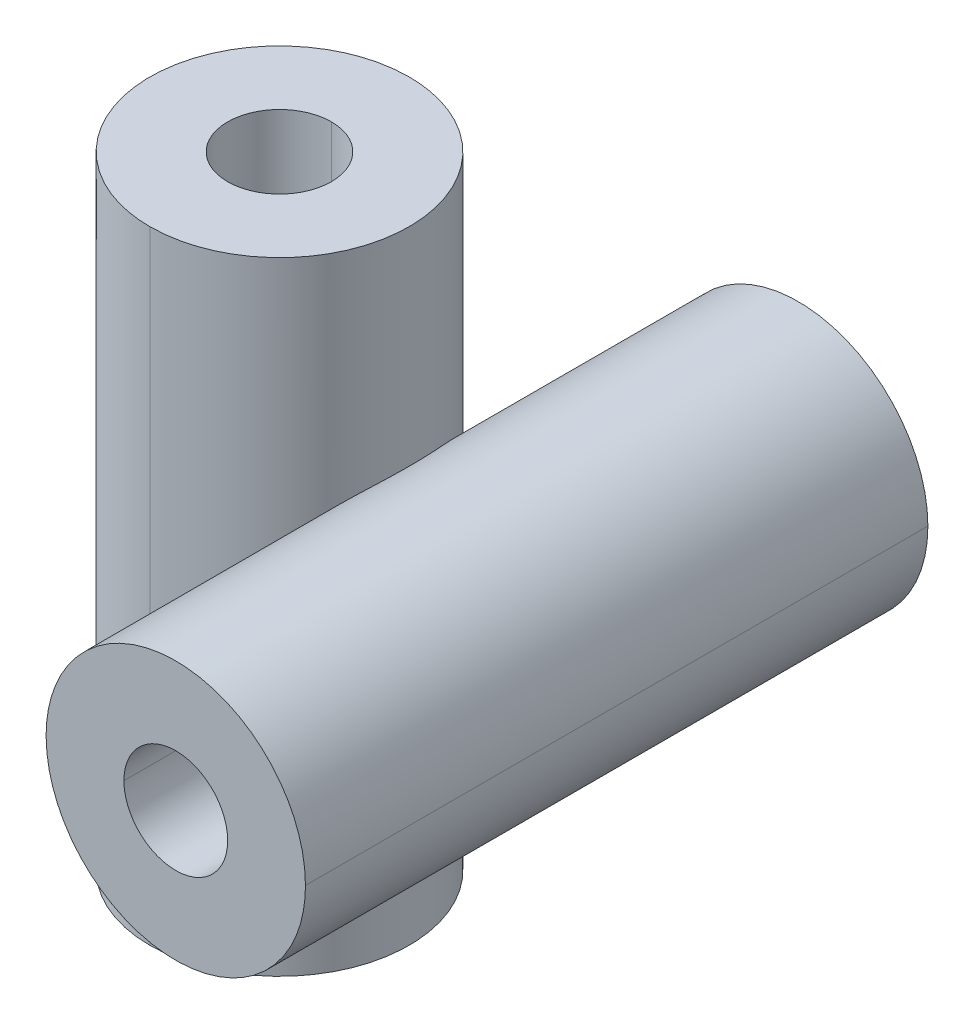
ISO-10303-21;
HEADER;
FILE_DESCRIPTION(('STEP AP214'),'2;1');
FILE_NAME('part.step','',(''),(''),'','','');
FILE_SCHEMA(('AUTOMOTIVE_DESIGN { 1 0 10303 214 1 1 1 1 }'));
ENDSEC;
DATA;
#1=APPLICATION_CONTEXT('core data for automotive mechanical design processes');
#2=APPLICATION_PROTOCOL_DEFINITION('international standard','automotive_design',2000,#1);
#3=PRODUCT_CONTEXT('',#1,'mechanical');
#4=PRODUCT('Part','Part','',(#3));
#5=PRODUCT_RELATED_PRODUCT_CATEGORY('part','',(#4));
#6=PRODUCT_DEFINITION_FORMATION('','',#4);
#7=PRODUCT_DEFINITION_CONTEXT('part definition',#1,'design');
#8=PRODUCT_DEFINITION('design','',#6,#7);
#9=PRODUCT_DEFINITION_SHAPE('','',#8);
#10=(LENGTH_UNIT() NAMED_UNIT(*) SI_UNIT(.MILLI.,.METRE.));
#11=(NAMED_UNIT(*) PLANE_ANGLE_UNIT() SI_UNIT($,.RADIAN.));
#12=(NAMED_UNIT(*) SI_UNIT($,.STERADIAN.) SOLID_ANGLE_UNIT());
#13=UNCERTAINTY_MEASURE_WITH_UNIT(LENGTH_MEASURE(1.E-05),#10,'distance_accuracy_value','');
#14=(GEOMETRIC_REPRESENTATION_CONTEXT(3) GLOBAL_UNCERTAINTY_ASSIGNED_CONTEXT((#13)) GLOBAL_UNIT_ASSIGNED_CONTEXT((#10,
#11,#12)) REPRESENTATION_CONTEXT('',''));
#15=CARTESIAN_POINT('',(0.,0.,0.));
#16=DIRECTION('',(0.,0.,1.));
#17=DIRECTION('',(1.,0.,0.));
#18=AXIS2_PLACEMENT_3D('',#15,#16,#17);
#19=CARTESIAN_POINT('',(5.00000096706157,14.9999984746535,-3.21976739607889E-07));
#20=DIRECTION('',(0.,-1.,0.));
#21=DIRECTION('',(1.,0.,0.));
#22=AXIS2_PLACEMENT_3D('',#19,#20,#21);
#23=CYLINDRICAL_SURFACE('',#22,6.25);
#24=CARTESIAN_POINT('',(5.00000096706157,14.9999984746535,-6.25000032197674));
#25=CARTESIAN_POINT('',(3.86146031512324,14.9999984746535,-6.24953774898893));
#26=CARTESIAN_POINT('',(2.74621364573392,14.9999984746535,-5.93979371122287));
#27=CARTESIAN_POINT('',(0.82773820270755,14.9999984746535,-4.78198901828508));
#28=CARTESIAN_POINT('',(0.0510330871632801,14.9999984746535,-3.97271947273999));
#29=CARTESIAN_POINT('',(-1.2024933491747,14.9999984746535,-1.68930926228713));
#30=CARTESIAN_POINT('',(-1.42642312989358,14.9999984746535,-0.15467208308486));
#31=CARTESIAN_POINT('',(-0.909966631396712,14.9999984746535,2.24599549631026));
#32=CARTESIAN_POINT('',(-0.499426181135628,14.9999984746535,3.11848841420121));
#33=CARTESIAN_POINT('',(1.07236510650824,14.9999984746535,5.11416372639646));
#34=CARTESIAN_POINT('',(2.49183642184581,14.9999984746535,5.94098080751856));
#35=CARTESIAN_POINT('',(4.37265824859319,14.9999984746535,6.22623705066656));
#36=CARTESIAN_POINT('',(4.6861106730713,14.9999984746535,6.24987214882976));
#37=CARTESIAN_POINT('',(5.00000096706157,14.9999984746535,6.24999967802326));
#38=B_SPLINE_CURVE_WITH_KNOTS('',3,(#24,#25,#26,#27,#28,#29,#30,#31,#32,#33,#34,#35,#36,#37),
.UNSPECIFIED.,.F.,.F.,(4,2,2,2,2,2,4),(0.,0.172601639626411,0.339653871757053,0.567466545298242,
0.711758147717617,0.952421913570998,1.),.UNSPECIFIED.);
#39=CARTESIAN_POINT('',(5.00000096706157,14.9999984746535,-6.25000032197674));
#40=VERTEX_POINT('',#39);
#41=CARTESIAN_POINT('',(5.00000096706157,14.9999984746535,6.24999967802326));
#42=VERTEX_POINT('',#41);
#43=EDGE_CURVE('E11',#40,#42,#38,.T.);
#44=ORIENTED_EDGE('',*,*,#43,.F.);
#45=CARTESIAN_POINT('',(5.00000096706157,14.9999984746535,-6.25000032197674));
#46=DIRECTION('',(0.,-1.,0.));
#47=VECTOR('',#46,1.);
#48=LINE('',#45,#47);
#49=CARTESIAN_POINT('',(5.00000096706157,-15.0000015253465,-6.25000032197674));
#50=VERTEX_POINT('',#49);
#51=EDGE_CURVE('E25',#40,#50,#48,.T.);
#52=ORIENTED_EDGE('',*,*,#51,.T.);
#53=CARTESIAN_POINT('',(5.00000096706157,-15.0000015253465,-3.21976739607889E-07));
#54=DIRECTION('',(0.,1.,0.));
#55=DIRECTION('',(0.,0.,-1.));
#56=AXIS2_PLACEMENT_3D('',#53,#54,#55);
#57=CIRCLE('',#56,6.25);
#58=CARTESIAN_POINT('',(5.00000096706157,-15.0000015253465,6.24999967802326));
#59=VERTEX_POINT('',#58);
#60=EDGE_CURVE('E148',#50,#59,#57,.T.);
#61=ORIENTED_EDGE('',*,*,#60,.T.);
#62=CARTESIAN_POINT('',(5.00000096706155,-15.0000015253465,6.24999967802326));
#63=DIRECTION('',(0.,1.,0.));
#64=VECTOR('',#63,1.);
#65=LINE('',#62,#64);
#66=EDGE_CURVE('E152',#59,#42,#65,.T.);
#67=ORIENTED_EDGE('',*,*,#66,.T.);
#68=EDGE_LOOP('',(#44,#52,#61,#67));
#69=FACE_BOUND('',#68,.T.);
#70=ADVANCED_FACE('F16',(#69),#23,.T.);
#71=CARTESIAN_POINT('',(5.00000096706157,14.9999984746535,-3.21976739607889E-07));
#72=DIRECTION('',(0.,-1.,0.));
#73=DIRECTION('',(-1.,0.,0.));
#74=AXIS2_PLACEMENT_3D('',#71,#72,#73);
#75=CYLINDRICAL_SURFACE('',#74,6.25);
#76=CARTESIAN_POINT('',(5.00000096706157,-15.0000015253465,-3.21976739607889E-07));
#77=DIRECTION('',(0.,1.,0.));
#78=DIRECTION('',(0.,0.,1.));
#79=AXIS2_PLACEMENT_3D('',#76,#77,#78);
#80=CIRCLE('',#79,6.25);
#81=EDGE_CURVE('E147',#59,#50,#80,.T.);
#82=ORIENTED_EDGE('',*,*,#81,.T.);
#83=ORIENTED_EDGE('',*,*,#51,.F.);
#84=CARTESIAN_POINT('',(5.00000096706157,14.9999984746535,6.24999967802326));
#85=CARTESIAN_POINT('',(6.13854161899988,14.9999984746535,6.24953710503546));
#86=CARTESIAN_POINT('',(7.25378828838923,14.9999984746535,5.93979306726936));
#87=CARTESIAN_POINT('',(9.17226373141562,14.9999984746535,4.78198837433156));
#88=CARTESIAN_POINT('',(9.94896884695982,14.9999984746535,3.97271882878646));
#89=CARTESIAN_POINT('',(11.2024952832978,14.9999984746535,1.68930861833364));
#90=CARTESIAN_POINT('',(11.4264250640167,14.9999984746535,0.15467143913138));
#91=CARTESIAN_POINT('',(10.9099685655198,14.9999984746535,-2.24599614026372));
#92=CARTESIAN_POINT('',(10.4994281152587,14.9999984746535,-3.11848905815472));
#93=CARTESIAN_POINT('',(8.92763682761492,14.9999984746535,-5.11416437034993));
#94=CARTESIAN_POINT('',(7.50816551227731,14.9999984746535,-5.94098145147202));
#95=CARTESIAN_POINT('',(5.62734368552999,14.9999984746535,-6.22623769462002));
#96=CARTESIAN_POINT('',(5.3138912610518,14.9999984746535,-6.24987279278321));
#97=CARTESIAN_POINT('',(5.00000096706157,14.9999984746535,-6.25000032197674));
#98=B_SPLINE_CURVE_WITH_KNOTS('',3,(#84,#85,#86,#87,#88,#89,#90,#91,#92,#93,#94,#95,#96,#97),
.UNSPECIFIED.,.F.,.F.,(4,2,2,2,2,2,4),(0.,0.172601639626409,0.339653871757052,0.567466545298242,
0.711758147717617,0.952421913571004,1.),.UNSPECIFIED.);
#99=EDGE_CURVE('E153',#42,#40,#98,.T.);
#100=ORIENTED_EDGE('',*,*,#99,.F.);
#101=ORIENTED_EDGE('',*,*,#66,.F.);
#102=EDGE_LOOP('',(#82,#83,#100,#101));
#103=FACE_BOUND('',#102,.T.);
#104=CARTESIAN_POINT('',(8.7500009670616,-1.52534650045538E-06,-5.0000003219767));
#105=CARTESIAN_POINT('',(8.75000052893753,0.0509860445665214,-5.00000277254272));
#106=CARTESIAN_POINT('',(8.750624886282,0.101973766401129,-4.99954361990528));
#107=CARTESIAN_POINT('',(8.75312501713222,0.204103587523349,-4.99769070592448));
#108=CARTESIAN_POINT('',(8.75500573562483,0.255245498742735,-4.99629325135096));
#109=CARTESIAN_POINT('',(8.76002896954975,0.357608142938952,-4.99254577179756));
#110=CARTESIAN_POINT('',(8.76317578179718,0.408828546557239,-4.99019250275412));
#111=CARTESIAN_POINT('',(8.77073578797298,0.511272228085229,-4.98451497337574));
#112=CARTESIAN_POINT('',(8.77515263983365,0.56249508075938,-4.98118790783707));
#113=CARTESIAN_POINT('',(8.78525231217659,0.664867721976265,-4.97354449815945));
#114=CARTESIAN_POINT('',(8.79093817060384,0.716017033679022,-4.96922577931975));
#115=CARTESIAN_POINT('',(8.80357021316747,0.818166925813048,-4.95958074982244));
#116=CARTESIAN_POINT('',(8.81051883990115,0.86916701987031,-4.9542524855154));
#117=CARTESIAN_POINT('',(8.82566562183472,0.970943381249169,-4.94257006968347));
#118=CARTESIAN_POINT('',(8.83386565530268,1.02171919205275,-4.93621437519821));
#119=CARTESIAN_POINT('',(8.85149932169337,1.12297275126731,-4.92245881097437));
#120=CARTESIAN_POINT('',(8.86093430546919,1.17345010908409,-4.91505779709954));
#121=CARTESIAN_POINT('',(8.88101687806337,1.27403367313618,-4.89919331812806));
#122=CARTESIAN_POINT('',(8.89166533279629,1.32413958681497,-4.89072909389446));
#123=CARTESIAN_POINT('',(8.91414887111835,1.42390859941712,-4.87271993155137));
#124=CARTESIAN_POINT('',(8.92598438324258,1.47357153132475,-4.8631746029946));
#125=CARTESIAN_POINT('',(8.95081118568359,1.57238461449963,-4.84298498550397));
#126=CARTESIAN_POINT('',(8.96380251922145,1.62153474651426,-4.83234065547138));
#127=CARTESIAN_POINT('',(8.99090536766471,1.71925422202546,-4.8099348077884));
#128=CARTESIAN_POINT('',(9.00501659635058,1.76782371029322,-4.79817357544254));
#129=CARTESIAN_POINT('',(9.03431904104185,1.86431609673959,-4.77351571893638));
#130=CARTESIAN_POINT('',(9.04950970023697,1.91223931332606,-4.76061967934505));
#131=CARTESIAN_POINT('',(9.08092638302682,2.00737579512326,-4.73367403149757));
#132=CARTESIAN_POINT('',(9.09715164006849,2.05458955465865,-4.71962527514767));
#133=CARTESIAN_POINT('',(9.1305886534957,2.14824641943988,-4.69035604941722));
#134=CARTESIAN_POINT('',(9.147799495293,2.19469018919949,-4.67513666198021));
#135=CARTESIAN_POINT('',(9.18315477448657,2.2867492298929,-4.64350806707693));
#136=CARTESIAN_POINT('',(9.20129821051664,2.33236532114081,-4.62710012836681));
#137=CARTESIAN_POINT('',(9.23846195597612,2.4227142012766,-4.59307636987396));
#138=CARTESIAN_POINT('',(9.257481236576,2.46744794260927,-4.5754619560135));
#139=CARTESIAN_POINT('',(9.29633636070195,2.55598051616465,-4.53900722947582));
#140=CARTESIAN_POINT('',(9.31617120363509,2.59978039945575,-4.52016840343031));
#141=CARTESIAN_POINT('',(9.35659381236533,2.68639700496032,-4.48124691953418));
#142=CARTESIAN_POINT('',(9.377180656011,2.72921483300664,-4.4611657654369));
#143=CARTESIAN_POINT('',(9.4190405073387,2.81382247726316,-4.41974165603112));
#144=CARTESIAN_POINT('',(9.44031271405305,2.85561339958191,-4.39840015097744));
#145=CARTESIAN_POINT('',(9.48347385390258,2.93812613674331,-4.3544378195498));
#146=CARTESIAN_POINT('',(9.50536214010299,2.97884899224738,-4.33181831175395));
#147=CARTESIAN_POINT('',(9.54968295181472,3.05918735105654,-4.28528112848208));
#148=CARTESIAN_POINT('',(9.57211500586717,3.09880375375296,-4.26136455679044));
#149=CARTESIAN_POINT('',(9.61745509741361,3.17690539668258,-4.21221474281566));
#150=CARTESIAN_POINT('',(9.64036294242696,3.21539107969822,-4.18698202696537));
#151=CARTESIAN_POINT('',(9.68660405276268,3.29124288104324,-4.13510718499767));
#152=CARTESIAN_POINT('',(9.70993789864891,3.32860725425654,-4.10846302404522));
#153=CARTESIAN_POINT('',(9.75695733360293,3.40218929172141,-4.05379079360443));
#154=CARTESIAN_POINT('',(9.78064339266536,3.43840517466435,-4.0257607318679));
#155=CARTESIAN_POINT('',(9.82827778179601,3.50964478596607,-3.96834656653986));
#156=CARTESIAN_POINT('',(9.85222635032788,3.54466728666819,-3.93896113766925));
#157=CARTESIAN_POINT('',(9.90029373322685,3.61347996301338,-3.87886805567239));
#158=CARTESIAN_POINT('',(9.92441263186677,3.64726946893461,-3.84815970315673));
#159=CARTESIAN_POINT('',(9.9727259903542,3.71358020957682,-3.78545211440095));
#160=CARTESIAN_POINT('',(9.99692045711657,3.74610132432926,-3.7534527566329));
#161=CARTESIAN_POINT('',(10.0452881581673,3.80984376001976,-3.68819470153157));
#162=CARTESIAN_POINT('',(10.0694613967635,3.84106549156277,-3.65493640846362));
#163=CARTESIAN_POINT('',(10.1176880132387,3.9021817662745,-3.58719196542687));
#164=CARTESIAN_POINT('',(10.1417414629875,3.93207722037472,-3.55270668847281));
#165=CARTESIAN_POINT('',(10.1896287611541,3.99051784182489,-3.48254010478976));
#166=CARTESIAN_POINT('',(10.2134628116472,4.01906437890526,-3.44686007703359));
#167=CARTESIAN_POINT('',(10.2608096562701,4.07478691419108,-3.37433483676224));
#168=CARTESIAN_POINT('',(10.2843228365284,4.10196468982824,-3.33749124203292));
#169=CARTESIAN_POINT('',(10.3309291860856,4.15493658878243,-3.26267365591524));
#170=CARTESIAN_POINT('',(10.3540229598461,4.18073282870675,-3.22470154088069));
#171=CARTESIAN_POINT('',(10.3996733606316,4.2309127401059,-3.14765605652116));
#172=CARTESIAN_POINT('',(10.4222309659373,4.25529912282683,-3.1085850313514));
#173=CARTESIAN_POINT('',(10.4667489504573,4.30269279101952,-3.02951604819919));
#174=CARTESIAN_POINT('',(10.4887111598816,4.32570464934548,-2.98952185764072));
#175=CARTESIAN_POINT('',(10.5319723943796,4.37037425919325,-2.90864719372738));
#176=CARTESIAN_POINT('',(10.553273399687,4.39203630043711,-2.86777014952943));
#177=CARTESIAN_POINT('',(10.5951599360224,4.43404320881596,-2.78516113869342));
#178=CARTESIAN_POINT('',(10.6157473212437,4.45439163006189,-2.74343191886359));
#179=CARTESIAN_POINT('',(10.6561569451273,4.49380687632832,-2.65914867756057));
#180=CARTESIAN_POINT('',(10.6759808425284,4.51287655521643,-2.6165967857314));
#181=CARTESIAN_POINT('',(10.7148169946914,4.54976927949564,-2.53069857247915));
#182=CARTESIAN_POINT('',(10.7338306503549,4.56759451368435,-2.48735382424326));
#183=CARTESIAN_POINT('',(10.7710027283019,4.60203226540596,-2.39990012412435));
#184=CARTESIAN_POINT('',(10.7891622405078,4.61864634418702,-2.35579225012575));
#185=CARTESIAN_POINT('',(10.8245852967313,4.65069455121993,-2.26684248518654));
#186=CARTESIAN_POINT('',(10.8418495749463,4.66612965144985,-2.22200123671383));
#187=CARTESIAN_POINT('',(10.875444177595,4.69585133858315,-2.13161484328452));
#188=CARTESIAN_POINT('',(10.8917748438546,4.71013834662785,-2.08606996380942));
#189=CARTESIAN_POINT('',(10.9234668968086,4.73759381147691,-1.9943063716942));
#190=CARTESIAN_POINT('',(10.9388282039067,4.75076217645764,-1.94808760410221));
#191=CARTESIAN_POINT('',(10.9685487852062,4.77600870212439,-1.85500624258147));
#192=CARTESIAN_POINT('',(10.9829075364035,4.78808629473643,-1.80814332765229));
#193=CARTESIAN_POINT('',(11.0105927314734,4.81117786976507,-1.7138036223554));
#194=CARTESIAN_POINT('',(11.0239181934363,4.82219084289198,-1.66632629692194));
#195=CARTESIAN_POINT('',(11.0495089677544,4.84317792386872,-1.57078767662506));
#196=CARTESIAN_POINT('',(11.0617728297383,4.85315061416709,-1.52272568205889));
#197=CARTESIAN_POINT('',(11.0852147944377,4.87207981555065,-1.4260475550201));
#198=CARTESIAN_POINT('',(11.0963909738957,4.88103453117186,-1.3774306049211));
#199=CARTESIAN_POINT('',(11.1176345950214,4.89794866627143,-1.27967244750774));
#200=CARTESIAN_POINT('',(11.1276996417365,4.90590594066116,-1.23053034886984));
#201=CARTESIAN_POINT('',(11.1466988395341,4.92084282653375,-1.13175137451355));
#202=CARTESIAN_POINT('',(11.1556301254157,4.92781996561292,-1.08211357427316));
#203=CARTESIAN_POINT('',(11.1723469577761,4.94081593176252,-0.982373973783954));
#204=CARTESIAN_POINT('',(11.1801291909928,4.9468319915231,-0.932271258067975));
#205=CARTESIAN_POINT('',(11.1945097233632,4.95790315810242,-0.831670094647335));
#206=CARTESIAN_POINT('',(11.2011052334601,4.9629560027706,-0.78117099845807));
#207=CARTESIAN_POINT('',(11.2130481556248,4.97207501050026,-0.679887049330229));
#208=CARTESIAN_POINT('',(11.2183943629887,4.97614022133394,-0.629101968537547));
#209=CARTESIAN_POINT('',(11.2278402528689,4.98330446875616,-0.527305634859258));
#210=CARTESIAN_POINT('',(11.231938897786,4.98640270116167,-0.476294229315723));
#211=CARTESIAN_POINT('',(11.238880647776,4.99164077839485,-0.374100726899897));
#212=CARTESIAN_POINT('',(11.2417228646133,4.99377994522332,-0.322918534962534));
#213=CARTESIAN_POINT('',(11.2461484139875,4.99710750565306,-0.220439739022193));
#214=CARTESIAN_POINT('',(11.2477310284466,4.99829535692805,-0.169143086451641));
#215=CARTESIAN_POINT('',(11.2496352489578,4.9997243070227,-0.0664914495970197));
#216=CARTESIAN_POINT('',(11.2499563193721,4.99996500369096,-0.0151364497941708));
#217=CARTESIAN_POINT('',(11.2493377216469,4.99950098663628,0.0875757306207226));
#218=CARTESIAN_POINT('',(11.2483977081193,4.99879601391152,0.138932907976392));
#219=CARTESIAN_POINT('',(11.2452592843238,4.99643908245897,0.241593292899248));
#220=CARTESIAN_POINT('',(11.2430607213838,4.99478700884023,0.292896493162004));
#221=CARTESIAN_POINT('',(11.2374097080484,4.99053146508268,0.395392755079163));
#222=CARTESIAN_POINT('',(11.2339572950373,4.98792802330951,0.44658581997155));
#223=CARTESIAN_POINT('',(11.2258052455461,4.98176249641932,0.548805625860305));
#224=CARTESIAN_POINT('',(11.2211058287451,4.97820058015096,0.599832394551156));
#225=CARTESIAN_POINT('',(11.2104686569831,4.97010808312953,0.701663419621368));
#226=CARTESIAN_POINT('',(11.2045312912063,4.96557780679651,0.752467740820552));
#227=CARTESIAN_POINT('',(11.191429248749,4.95553573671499,0.853797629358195));
#228=CARTESIAN_POINT('',(11.1842651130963,4.95002437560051,0.904323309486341));
#229=CARTESIAN_POINT('',(11.1687231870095,4.93800485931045,1.0050398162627));
#230=CARTESIAN_POINT('',(11.1603460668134,4.93149725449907,1.05523081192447));
#231=CARTESIAN_POINT('',(11.1423928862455,4.91746627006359,1.15522127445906));
#232=CARTESIAN_POINT('',(11.1328175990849,4.90994354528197,1.20502097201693));
#233=CARTESIAN_POINT('',(11.1124900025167,4.8938646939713,1.30417427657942));
#234=CARTESIAN_POINT('',(11.1017385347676,4.88530930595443,1.35352817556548));
#235=CARTESIAN_POINT('',(11.0790674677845,4.86713220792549,1.4517172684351));
#236=CARTESIAN_POINT('',(11.0671490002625,4.85751152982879,1.50055291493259));
#237=CARTESIAN_POINT('',(11.0422768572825,4.83726799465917,1.59752667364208));
#238=CARTESIAN_POINT('',(11.0293276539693,4.82664943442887,1.64566683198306));
#239=CARTESIAN_POINT('',(11.0024371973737,4.8044013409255,1.74117939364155));
#240=CARTESIAN_POINT('',(10.9885008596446,4.79277676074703,1.78855433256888));
#241=CARTESIAN_POINT('',(10.9596614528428,4.76848991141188,1.88252275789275));
#242=CARTESIAN_POINT('',(10.9447624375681,4.75583194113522,1.9291185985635));
#243=CARTESIAN_POINT('',(10.914027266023,4.72945168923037,2.02151639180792));
#244=CARTESIAN_POINT('',(10.8981942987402,4.71573298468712,2.06732042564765));
#245=CARTESIAN_POINT('',(10.8656226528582,4.6872027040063,2.15812194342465));
#246=CARTESIAN_POINT('',(10.8488863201,4.67239392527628,2.20312114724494));
#247=CARTESIAN_POINT('',(10.8145419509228,4.64165367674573,2.29230051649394));
#248=CARTESIAN_POINT('',(10.7969354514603,4.62572416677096,2.33648194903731));
#249=CARTESIAN_POINT('',(10.7608872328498,4.59271134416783,2.42401335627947));
#250=CARTESIAN_POINT('',(10.7424462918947,4.57562909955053,2.46736405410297));
#251=CARTESIAN_POINT('',(10.704768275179,4.54027856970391,2.55322166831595));
#252=CARTESIAN_POINT('',(10.6855312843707,4.52201041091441,2.59572867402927));
#253=CARTESIAN_POINT('',(10.6463029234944,4.48425481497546,2.67988667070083));
#254=CARTESIAN_POINT('',(10.6263110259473,4.46476651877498,2.72153703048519));
#255=CARTESIAN_POINT('',(10.5856173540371,4.42453654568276,2.80396957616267));
#256=CARTESIAN_POINT('',(10.564914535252,4.40379298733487,2.8447503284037));
#257=CARTESIAN_POINT('',(10.522846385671,4.36101771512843,2.92543162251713));
#258=CARTESIAN_POINT('',(10.5014796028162,4.33898306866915,2.96532985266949));
#259=CARTESIAN_POINT('',(10.4581337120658,4.2935901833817,3.04423397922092));
#260=CARTESIAN_POINT('',(10.4361528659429,4.27022794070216,3.08323661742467));
#261=CARTESIAN_POINT('',(10.3916324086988,4.22214450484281,3.16033810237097));
#262=CARTESIAN_POINT('',(10.3690909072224,4.19741822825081,3.19843268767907));
#263=CARTESIAN_POINT('',(10.3235126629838,4.14657870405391,3.27369077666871));
#264=CARTESIAN_POINT('',(10.3004741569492,4.12045975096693,3.31084935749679));
#265=CARTESIAN_POINT('',(10.254182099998,4.06705483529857,3.38389410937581));
#266=CARTESIAN_POINT('',(10.2309297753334,4.0397739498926,3.41978476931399));
#267=CARTESIAN_POINT('',(10.184341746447,3.98412124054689,3.49016352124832));
#268=CARTESIAN_POINT('',(10.1610076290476,3.95575789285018,3.5246593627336));
#269=CARTESIAN_POINT('',(10.1142938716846,3.89791345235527,3.59228414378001));
#270=CARTESIAN_POINT('',(10.090915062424,3.86843875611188,3.62541912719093));
#271=CARTESIAN_POINT('',(10.0441518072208,3.80834503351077,3.69035805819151));
#272=CARTESIAN_POINT('',(10.0207676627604,3.77773033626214,3.72216622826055));
#273=CARTESIAN_POINT('',(9.97403586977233,3.71533040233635,3.78448749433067));
#274=CARTESIAN_POINT('',(9.95068823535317,3.68354747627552,3.81500291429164));
#275=CARTESIAN_POINT('',(9.90407385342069,3.61878529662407,3.87477468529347));
#276=CARTESIAN_POINT('',(9.8808070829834,3.58580641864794,3.90403142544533));
#277=CARTESIAN_POINT('',(9.83440118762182,3.51862712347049,3.96132196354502));
#278=CARTESIAN_POINT('',(9.81126225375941,3.48442526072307,3.98935422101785));
#279=CARTESIAN_POINT('',(9.76516111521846,3.41477525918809,4.04423153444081));
#280=CARTESIAN_POINT('',(9.74219955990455,3.37932399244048,4.07107316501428));
#281=CARTESIAN_POINT('',(9.69650508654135,3.30715182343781,4.12360628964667));
#282=CARTESIAN_POINT('',(9.67377350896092,3.2704262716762,4.14929256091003));
#283=CARTESIAN_POINT('',(9.62859222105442,3.19568076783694,4.19954675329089));
#284=CARTESIAN_POINT('',(9.6061447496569,3.15765480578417,4.22410774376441));
#285=CARTESIAN_POINT('',(9.56159386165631,3.08029624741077,4.27216080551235));
#286=CARTESIAN_POINT('',(9.53949376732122,3.04095659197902,4.29564459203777));
#287=CARTESIAN_POINT('',(9.49577795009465,2.96109761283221,4.34141618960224));
#288=CARTESIAN_POINT('',(9.47416420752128,2.92057462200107,4.36369949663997));
#289=CARTESIAN_POINT('',(9.43154015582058,2.838464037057,4.40700556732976));
#290=CARTESIAN_POINT('',(9.41053071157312,2.79687506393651,4.42802656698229));
#291=CARTESIAN_POINT('',(9.36918605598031,2.71267729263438,4.46883205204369));
#292=CARTESIAN_POINT('',(9.34885186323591,2.67006710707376,4.48861470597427));
#293=CARTESIAN_POINT('',(9.30892385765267,2.58387165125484,4.52695927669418));
#294=CARTESIAN_POINT('',(9.28933117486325,2.54028504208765,4.54551935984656));
#295=CARTESIAN_POINT('',(9.25094978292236,2.45218575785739,4.58143668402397));
#296=CARTESIAN_POINT('',(9.23216226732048,2.40767184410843,4.59879216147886));
#297=CARTESIAN_POINT('',(9.1954513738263,2.31776997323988,4.63231751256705));
#298=CARTESIAN_POINT('',(9.1775291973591,2.27238091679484,4.64848575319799));
#299=CARTESIAN_POINT('',(9.14260564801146,2.18078398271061,4.67965396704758));
#300=CARTESIAN_POINT('',(9.12560542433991,2.13457517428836,4.69465249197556));
#301=CARTESIAN_POINT('',(9.09257867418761,2.0413969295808,4.72349851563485));
#302=CARTESIAN_POINT('',(9.07655318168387,1.99442675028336,4.73734479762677));
#303=CARTESIAN_POINT('',(9.04552481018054,1.89978678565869,4.763903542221));
#304=CARTESIAN_POINT('',(9.03052278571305,1.85211645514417,4.77661506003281));
#305=CARTESIAN_POINT('',(9.00158608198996,1.75613984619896,4.80092144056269));
#306=CARTESIAN_POINT('',(8.98765201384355,1.70783322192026,4.8125156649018));
#307=CARTESIAN_POINT('',(8.96089158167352,1.61065011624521,4.83460458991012));
#308=CARTESIAN_POINT('',(8.94806552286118,1.56177348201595,4.84509898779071));
#309=CARTESIAN_POINT('',(8.92355692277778,1.46351865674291,4.8650053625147));
#310=CARTESIAN_POINT('',(8.91187432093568,1.41414049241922,4.87441739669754));
#311=CARTESIAN_POINT('',(8.88968374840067,1.31495287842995,4.89217612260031));
#312=CARTESIAN_POINT('',(8.87917529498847,1.2651436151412,4.90052325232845));
#313=CARTESIAN_POINT('',(8.85935929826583,1.16516579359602,4.91616922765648));
#314=CARTESIAN_POINT('',(8.85005079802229,1.11499755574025,4.92346890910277));
#315=CARTESIAN_POINT('',(8.83265603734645,1.01437523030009,4.93703702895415));
#316=CARTESIAN_POINT('',(8.82456829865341,0.963921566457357,4.94330671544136));
#317=CARTESIAN_POINT('',(8.80963135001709,0.862803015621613,4.95483187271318));
#318=CARTESIAN_POINT('',(8.80278009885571,0.812138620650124,4.96008901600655));
#319=CARTESIAN_POINT('',(8.79032729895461,0.710674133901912,4.96960609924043));
#320=CARTESIAN_POINT('',(8.78472311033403,0.659874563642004,4.97386814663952));
#321=CARTESIAN_POINT('',(8.77477046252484,0.558215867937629,4.98141204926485));
#322=CARTESIAN_POINT('',(8.77041873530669,0.50735725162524,4.98469645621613));
#323=CARTESIAN_POINT('',(8.76297180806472,0.405656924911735,4.99030204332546));
#324=CARTESIAN_POINT('',(8.75987268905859,0.354815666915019,4.99262622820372));
#325=CARTESIAN_POINT('',(8.75492676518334,0.253226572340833,4.99632846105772));
#326=CARTESIAN_POINT('',(8.75307537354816,0.202479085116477,4.9977099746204));
#327=CARTESIAN_POINT('',(8.75061489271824,0.101153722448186,4.99954344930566));
#328=CARTESIAN_POINT('',(8.75000054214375,0.0505760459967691,4.99999934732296));
#329=CARTESIAN_POINT('',(8.7500009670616,-1.52534650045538E-06,4.9999996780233));
#330=B_SPLINE_CURVE_WITH_KNOTS('',3,(#104,#105,#106,#107,#108,#109,#110,#111,#112,#113,#114,
#115,#116,#117,#118,#119,#120,#121,#122,#123,#124,#125,#126,#127,#128,#129,#130,#131,#132,#133,
#134,#135,#136,#137,#138,#139,#140,#141,#142,#143,#144,#145,#146,#147,#148,#149,#150,#151,#152,
#153,#154,#155,#156,#157,#158,#159,#160,#161,#162,#163,#164,#165,#166,#167,#168,#169,#170,#171,
#172,#173,#174,#175,#176,#177,#178,#179,#180,#181,#182,#183,#184,#185,#186,#187,#188,#189,#190,
#191,#192,#193,#194,#195,#196,#197,#198,#199,#200,#201,#202,#203,#204,#205,#206,#207,#208,#209,
#210,#211,#212,#213,#214,#215,#216,#217,#218,#219,#220,#221,#222,#223,#224,#225,#226,#227,#228,
#229,#230,#231,#232,#233,#234,#235,#236,#237,#238,#239,#240,#241,#242,#243,#244,#245,#246,#247,
#248,#249,#250,#251,#252,#253,#254,#255,#256,#257,#258,#259,#260,#261,#262,#263,#264,#265,#266,
#267,#268,#269,#270,#271,#272,#273,#274,#275,#276,#277,#278,#279,#280,#281,#282,#283,#284,#285,
#286,#287,#288,#289,#290,#291,#292,#293,#294,#295,#296,#297,#298,#299,#300,#301,#302,#303,#304,
#305,#306,#307,#308,#309,#310,#311,#312,#313,#314,#315,#316,#317,#318,#319,#320,#321,#322,#323,
#324,#325,#326,#327,#328,#329),.UNSPECIFIED.,.F.,.F.,(4,2,2,2,2,2,2,2,2,2,2,2,2,2,2,2,2,2,2,2,2,
2,2,2,2,2,2,2,2,2,2,2,2,2,2,2,2,2,2,2,2,2,2,2,2,2,2,2,2,2,2,2,2,2,2,2,2,2,2,2,2,2,2,2,2,2,2,2,2,
2,2,2,2,2,2,2,2,2,2,2,2,2,2,2,2,2,2,2,2,2,2,2,2,2,2,2,2,2,2,2,2,2,2,2,2,2,2,2,2,2,2,2,4),(0.,
0.152956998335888,0.306519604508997,0.460607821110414,0.61514436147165,0.770054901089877,
0.92526833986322,1.08071707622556,1.23633729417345,1.39206926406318,1.54785765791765,
1.70365187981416,1.85940641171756,2.01508117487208,2.17064190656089,2.32606055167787,
2.48131566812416,2.63639284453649,2.79128512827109,2.94599346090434,3.10052711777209,
3.25490414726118,3.40915180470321,3.5633382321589,3.7177533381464,3.87239726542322,
4.02719574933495,4.18207709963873,4.3369730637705,4.49181970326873,4.64655828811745,
4.80113621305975,4.95550793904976,5.10963596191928,5.26345698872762,5.41673394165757,
5.56949592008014,5.72182558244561,5.87380311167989,6.02550622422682,6.17701019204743,
6.32838787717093,6.47970977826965,6.63104408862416,6.78245676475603,6.93401160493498,
7.08577033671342,7.23779271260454,7.39013661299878,7.54285815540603,7.6960118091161,
7.84952083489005,8.00317728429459,8.15696118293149,8.31085362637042,8.4648337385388,
8.61887922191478,8.7729669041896,8.92707328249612,9.08117506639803,9.23524972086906,
9.3892760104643,9.54323454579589,9.69710833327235,9.85088332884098,10.0045489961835,
10.1580670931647,10.3109520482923,10.463122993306,10.6146903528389,10.7657671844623,
10.9164689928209,11.0669135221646,11.2172205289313,11.3675115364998,11.5179095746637,
11.6685389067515,11.8195247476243,11.9709929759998,12.1230698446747,12.2758264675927,
12.4279730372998,12.5791062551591,12.7294731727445,12.8793179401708,13.0288807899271,
13.1783970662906,13.3280963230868,13.4782015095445,13.6289282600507,13.7804842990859,
13.9330579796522,14.0861690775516,14.2394893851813,14.3930313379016,14.5467985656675,
14.7007863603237,14.8549821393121,15.0093659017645,15.163910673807,15.3185829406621,
15.4733430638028,15.6281456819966,15.7829400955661,15.937670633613,16.0922770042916,
16.246694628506,16.4008549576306,16.5546857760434,16.7081114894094,16.861053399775,
17.0134299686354,17.1651570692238),.UNSPECIFIED.);
#331=CARTESIAN_POINT('',(8.75000096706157,-1.52534652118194E-06,-5.00000032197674));
#332=VERTEX_POINT('',#331);
#333=CARTESIAN_POINT('',(8.75000096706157,-1.52534652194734E-06,4.99999967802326));
#334=VERTEX_POINT('',#333);
#335=EDGE_CURVE('E155',#332,#334,#330,.T.);
#336=ORIENTED_EDGE('',*,*,#335,.F.);
#337=CARTESIAN_POINT('',(8.7500009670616,-1.52534652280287E-06,4.9999996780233));
#338=CARTESIAN_POINT('',(8.75000052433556,-0.0511124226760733,4.99999934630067));
#339=CARTESIAN_POINT('',(8.75062790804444,-0.102223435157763,4.9995343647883));
#340=CARTESIAN_POINT('',(8.75314021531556,-0.204602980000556,4.99766419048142));
#341=CARTESIAN_POINT('',(8.75503018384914,-0.255871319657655,4.99625522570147));
#342=CARTESIAN_POINT('',(8.76007824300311,-0.358488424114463,4.99247952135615));
#343=CARTESIAN_POINT('',(8.76324070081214,-0.409836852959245,4.99010948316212));
#344=CARTESIAN_POINT('',(8.77083837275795,-0.512536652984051,4.9843935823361));
#345=CARTESIAN_POINT('',(8.77527728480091,-0.563887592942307,4.98104488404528));
#346=CARTESIAN_POINT('',(8.78542735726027,-0.666514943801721,4.97335375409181));
#347=CARTESIAN_POINT('',(8.79114156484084,-0.717790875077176,4.96900894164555));
#348=CARTESIAN_POINT('',(8.80383634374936,-0.820191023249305,4.95930764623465));
#349=CARTESIAN_POINT('',(8.81081933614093,-0.871314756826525,4.95394922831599));
#350=CARTESIAN_POINT('',(8.82604050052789,-0.973333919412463,4.94220280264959));
#351=CARTESIAN_POINT('',(8.83428049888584,-1.02422890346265,4.93581329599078));
#352=CARTESIAN_POINT('',(8.85199921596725,-1.12571486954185,4.92198678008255));
#353=CARTESIAN_POINT('',(8.86147920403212,-1.17630548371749,4.9145486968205));
#354=CARTESIAN_POINT('',(8.8816562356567,-1.27710820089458,4.89860712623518));
#355=CARTESIAN_POINT('',(8.89235403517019,-1.3273200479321,4.8901029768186));
#356=CARTESIAN_POINT('',(8.91493990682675,-1.42729219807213,4.87201138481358));
#357=CARTESIAN_POINT('',(8.92682827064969,-1.47705238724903,4.86242367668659));
#358=CARTESIAN_POINT('',(8.95176348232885,-1.5760499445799,4.84214709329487));
#359=CARTESIAN_POINT('',(8.96481021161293,-1.62528736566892,4.83145833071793));
#360=CARTESIAN_POINT('',(8.99202549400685,-1.72317013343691,4.80896178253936));
#361=CARTESIAN_POINT('',(9.00619357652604,-1.77181571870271,4.79715446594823));
#362=CARTESIAN_POINT('',(9.03561018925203,-1.86844784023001,4.7724029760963));
#363=CARTESIAN_POINT('',(9.05085795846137,-1.91643481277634,4.75945960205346));
#364=CARTESIAN_POINT('',(9.08238802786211,-2.01168525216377,4.73241818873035));
#365=CARTESIAN_POINT('',(9.09866934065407,-2.05894935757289,4.71832124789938));
#366=CARTESIAN_POINT('',(9.13221623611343,-2.15269234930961,4.68895492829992));
#367=CARTESIAN_POINT('',(9.14948067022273,-2.199172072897,4.67368691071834));
#368=CARTESIAN_POINT('',(9.18493940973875,-2.29128752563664,4.64196068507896));
#369=CARTESIAN_POINT('',(9.20313247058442,-2.33692427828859,4.62550405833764));
#370=CARTESIAN_POINT('',(9.2403901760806,-2.42729817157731,4.5913829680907));
#371=CARTESIAN_POINT('',(9.25945354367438,-2.47203649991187,4.57372025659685));
#372=CARTESIAN_POINT('',(9.29838985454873,-2.56056111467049,4.53716916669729));
#373=CARTESIAN_POINT('',(9.31826154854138,-2.60434872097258,4.51828265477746));
#374=CARTESIAN_POINT('',(9.35874931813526,-2.69092328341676,4.4792670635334));
#375=CARTESIAN_POINT('',(9.37936422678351,-2.73371164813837,4.45913989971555));
#376=CARTESIAN_POINT('',(9.42126927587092,-2.81824121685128,4.41762292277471));
#377=CARTESIAN_POINT('',(9.4425583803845,-2.85998386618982,4.39623500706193));
#378=CARTESIAN_POINT('',(9.48574329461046,-2.9423853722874,4.35218816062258));
#379=CARTESIAN_POINT('',(9.50763824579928,-2.98304561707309,4.32953098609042));
#380=CARTESIAN_POINT('',(9.55200554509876,-3.06332524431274,4.28283469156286));
#381=CARTESIAN_POINT('',(9.57447857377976,-3.10294327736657,4.25879389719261));
#382=CARTESIAN_POINT('',(9.6199555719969,-3.18114322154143,4.20929917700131));
#383=CARTESIAN_POINT('',(9.64296071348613,-3.21972233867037,4.18384191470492));
#384=CARTESIAN_POINT('',(9.6894157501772,-3.29578275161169,4.1315467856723));
#385=CARTESIAN_POINT('',(9.71286635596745,-3.33326199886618,4.10470657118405));
#386=CARTESIAN_POINT('',(9.760119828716,-3.40706295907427,4.04967180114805));
#387=CARTESIAN_POINT('',(9.78392304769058,-3.44338338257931,4.02147581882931));
#388=CARTESIAN_POINT('',(9.83178556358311,-3.51481283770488,3.96375752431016));
#389=CARTESIAN_POINT('',(9.85584496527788,-3.5499213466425,3.93423465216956));
#390=CARTESIAN_POINT('',(9.90411984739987,-3.61887795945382,3.87389018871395));
#391=CARTESIAN_POINT('',(9.92833529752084,-3.65272629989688,3.84306884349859));
#392=CARTESIAN_POINT('',(9.97681906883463,-3.71911862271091,3.78015521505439));
#393=CARTESIAN_POINT('',(10.0010873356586,-3.75166357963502,3.74806391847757));
#394=CARTESIAN_POINT('',(10.0495708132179,-3.81541012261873,3.68263823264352));
#395=CARTESIAN_POINT('',(10.0737860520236,-3.84661338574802,3.64930549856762));
#396=CARTESIAN_POINT('',(10.1220550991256,-3.90764213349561,3.58142473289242));
#397=CARTESIAN_POINT('',(10.1461091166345,-3.93746994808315,3.54687894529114));
#398=CARTESIAN_POINT('',(10.1939461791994,-3.99571852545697,3.47660042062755));
#399=CARTESIAN_POINT('',(10.2177296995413,-4.02414220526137,3.44087042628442));
#400=CARTESIAN_POINT('',(10.2649247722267,-4.0795697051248,3.3682313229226));
#401=CARTESIAN_POINT('',(10.2883369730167,-4.10657624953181,3.33132471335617));
#402=CARTESIAN_POINT('',(10.3347651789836,-4.15924499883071,3.25636055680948));
#403=CARTESIAN_POINT('',(10.3577813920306,-4.18490792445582,3.21830364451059));
#404=CARTESIAN_POINT('',(10.4033454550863,-4.23490433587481,3.14107892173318));
#405=CARTESIAN_POINT('',(10.4258934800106,-4.25923832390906,3.1019115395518));
#406=CARTESIAN_POINT('',(10.4704516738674,-4.30659412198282,3.02251537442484));
#407=CARTESIAN_POINT('',(10.4924620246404,-4.32961637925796,2.98228696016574));
#408=CARTESIAN_POINT('',(10.5358762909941,-4.37436575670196,2.9008166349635));
#409=CARTESIAN_POINT('',(10.557280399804,-4.39609329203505,2.85957505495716));
#410=CARTESIAN_POINT('',(10.5994157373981,-4.43827122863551,2.77612669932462));
#411=CARTESIAN_POINT('',(10.6201471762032,-4.45872203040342,2.73392023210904));
#412=CARTESIAN_POINT('',(10.6608726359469,-4.49836485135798,2.64859028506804));
#413=CARTESIAN_POINT('',(10.6808668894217,-4.51755726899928,2.60546710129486));
#414=CARTESIAN_POINT('',(10.7200554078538,-4.55470180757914,2.51835189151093));
#415=CARTESIAN_POINT('',(10.7392499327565,-4.57265433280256,2.47436015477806));
#416=CARTESIAN_POINT('',(10.77677870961,-4.60733767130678,2.38555612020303));
#417=CARTESIAN_POINT('',(10.7951132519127,-4.62406889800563,2.34074410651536));
#418=CARTESIAN_POINT('',(10.8308630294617,-4.65632715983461,2.25034733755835));
#419=CARTESIAN_POINT('',(10.84827858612,-4.67185461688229,2.20476285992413));
#420=CARTESIAN_POINT('',(10.8821367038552,-4.70172495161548,2.11287070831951));
#421=CARTESIAN_POINT('',(10.8985796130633,-4.71606825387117,2.06656330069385));
#422=CARTESIAN_POINT('',(10.9304284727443,-4.74357852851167,1.97326997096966));
#423=CARTESIAN_POINT('',(10.9458348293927,-4.75674596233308,1.92628432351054));
#424=CARTESIAN_POINT('',(10.9755847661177,-4.78194187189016,1.83175021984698));
#425=CARTESIAN_POINT('',(10.9899297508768,-4.79397185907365,1.78420260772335));
#426=CARTESIAN_POINT('',(11.0175313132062,-4.81692555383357,1.68861612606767));
#427=CARTESIAN_POINT('',(11.0307896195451,-4.82785102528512,1.64057817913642));
#428=CARTESIAN_POINT('',(11.0561906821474,-4.84862290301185,1.54405292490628));
#429=CARTESIAN_POINT('',(11.0683349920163,-4.85847081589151,1.4955663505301));
#430=CARTESIAN_POINT('',(11.0914869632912,-4.8771153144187,1.39818739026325));
#431=CARTESIAN_POINT('',(11.1024960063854,-4.88591318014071,1.34929557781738));
#432=CARTESIAN_POINT('',(11.1233579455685,-4.90248213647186,1.25114920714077));
#433=CARTESIAN_POINT('',(11.133212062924,-4.91025431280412,1.2018950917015));
#434=CARTESIAN_POINT('',(11.1517473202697,-4.92479415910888,1.10306727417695));
#435=CARTESIAN_POINT('',(11.1604295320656,-4.93156274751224,1.05349390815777));
#436=CARTESIAN_POINT('',(11.1766064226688,-4.94411508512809,0.954070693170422));
#437=CARTESIAN_POINT('',(11.1841020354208,-4.94989960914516,0.904221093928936));
#438=CARTESIAN_POINT('',(11.1978934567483,-4.96050090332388,0.804288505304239));
#439=CARTESIAN_POINT('',(11.2041900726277,-4.96531832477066,0.754205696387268));
#440=CARTESIAN_POINT('',(11.215573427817,-4.97399985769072,0.653849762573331));
#441=CARTESIAN_POINT('',(11.2206608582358,-4.97786451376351,0.603576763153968));
#442=CARTESIAN_POINT('',(11.2296179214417,-4.98465229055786,0.502883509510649));
#443=CARTESIAN_POINT('',(11.2334881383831,-4.98757586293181,0.452463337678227));
#444=CARTESIAN_POINT('',(11.2400049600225,-4.99249055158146,0.351518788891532));
#445=CARTESIAN_POINT('',(11.2426520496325,-4.99448203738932,0.300994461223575));
#446=CARTESIAN_POINT('',(11.2467188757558,-4.99753892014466,0.199884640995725));
#447=CARTESIAN_POINT('',(11.2481390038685,-4.99860461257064,0.149299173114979));
#448=CARTESIAN_POINT('',(11.2497502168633,-4.99981355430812,0.0481101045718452));
#449=CARTESIAN_POINT('',(11.2499416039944,-4.99995703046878,-0.00249348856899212));
#450=CARTESIAN_POINT('',(11.2490956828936,-4.99932246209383,-0.10367578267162));
#451=CARTESIAN_POINT('',(11.2480585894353,-4.99854457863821,-0.154254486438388));
#452=CARTESIAN_POINT('',(11.244758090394,-4.99606549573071,-0.255343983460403));
#453=CARTESIAN_POINT('',(11.2424948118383,-4.99436439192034,-0.305854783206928));
#454=CARTESIAN_POINT('',(11.2367463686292,-4.99003436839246,-0.406765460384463));
#455=CARTESIAN_POINT('',(11.2332612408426,-4.98740547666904,-0.457165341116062));
#456=CARTESIAN_POINT('',(11.2250755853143,-4.98121269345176,-0.557811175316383));
#457=CARTESIAN_POINT('',(11.2203749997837,-4.97764875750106,-0.608057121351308));
#458=CARTESIAN_POINT('',(11.2097670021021,-4.9695760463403,-0.708352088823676));
#459=CARTESIAN_POINT('',(11.2038594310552,-4.9650671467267,-0.758401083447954));
#460=CARTESIAN_POINT('',(11.190848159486,-4.95509204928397,-0.85825915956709));
#461=CARTESIAN_POINT('',(11.1837441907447,-4.94962563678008,-0.908068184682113));
#462=CARTESIAN_POINT('',(11.1683529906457,-4.93772047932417,-1.0074033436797));
#463=CARTESIAN_POINT('',(11.1600653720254,-4.93128141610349,-1.05692937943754));
#464=CARTESIAN_POINT('',(11.1423219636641,-4.91741340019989,-1.15565559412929));
#465=CARTESIAN_POINT('',(11.1328656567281,-4.90998400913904,-1.20485561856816));
#466=CARTESIAN_POINT('',(11.1128022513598,-4.89411531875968,-1.30288686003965));
#467=CARTESIAN_POINT('',(11.1021944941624,-4.8856754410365,-1.35171784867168));
#468=CARTESIAN_POINT('',(11.0798479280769,-4.86776336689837,-1.44896808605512));
#469=CARTESIAN_POINT('',(11.0681083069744,-4.85829042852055,-1.49738701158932));
#470=CARTESIAN_POINT('',(11.0435201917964,-4.83828750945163,-1.59377021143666));
#471=CARTESIAN_POINT('',(11.0306707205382,-4.82775659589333,-1.64173404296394));
#472=CARTESIAN_POINT('',(11.0038876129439,-4.80561078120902,-1.7371641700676));
#473=CARTESIAN_POINT('',(10.9899528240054,-4.79399472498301,-1.78462987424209));
#474=CARTESIAN_POINT('',(10.961026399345,-4.76964954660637,-1.87902088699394));
#475=CARTESIAN_POINT('',(10.9460334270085,-4.75691901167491,-1.92594542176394));
#476=CARTESIAN_POINT('',(10.9150207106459,-4.73031381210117,-2.01921128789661));
#477=CARTESIAN_POINT('',(10.8989994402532,-4.71643743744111,-2.06555162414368));
#478=CARTESIAN_POINT('',(10.8659628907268,-4.68750748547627,-2.15760626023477));
#479=CARTESIAN_POINT('',(10.8489458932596,-4.6724518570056,-2.2033192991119));
#480=CARTESIAN_POINT('',(10.8139541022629,-4.64112898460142,-2.29407679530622));
#481=CARTESIAN_POINT('',(10.795977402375,-4.62485930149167,-2.33911967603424));
#482=CARTESIAN_POINT('',(10.759117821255,-4.59108378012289,-2.42845884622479));
#483=CARTESIAN_POINT('',(10.7402335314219,-4.57357599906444,-2.47275382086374));
#484=CARTESIAN_POINT('',(10.7016405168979,-4.53732421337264,-2.5604097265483));
#485=CARTESIAN_POINT('',(10.681932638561,-4.51858146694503,-2.60377155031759));
#486=CARTESIAN_POINT('',(10.6417711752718,-4.47985761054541,-2.68952170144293));
#487=CARTESIAN_POINT('',(10.6213184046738,-4.4598778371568,-2.73191101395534));
#488=CARTESIAN_POINT('',(10.5797355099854,-4.41866753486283,-2.81568394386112));
#489=CARTESIAN_POINT('',(10.5586059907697,-4.39743810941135,-2.85706840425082));
#490=CARTESIAN_POINT('',(10.5157413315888,-4.35371856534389,-2.93880082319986));
#491=CARTESIAN_POINT('',(10.4940066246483,-4.33122933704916,-2.97914948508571));
#492=CARTESIAN_POINT('',(10.4500041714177,-4.28498079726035,-3.05877912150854));
#493=CARTESIAN_POINT('',(10.4277367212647,-4.26122218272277,-3.09806066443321));
#494=CARTESIAN_POINT('',(10.3827427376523,-4.21242687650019,-3.17552497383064));
#495=CARTESIAN_POINT('',(10.3600163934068,-4.18739070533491,-3.21370817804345));
#496=CARTESIAN_POINT('',(10.3141796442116,-4.13603378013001,-3.28894468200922));
#497=CARTESIAN_POINT('',(10.2910693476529,-4.10971338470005,-3.32599829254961));
#498=CARTESIAN_POINT('',(10.2445406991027,-4.05578329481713,-3.3989445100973));
#499=CARTESIAN_POINT('',(10.221122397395,-4.02817380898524,-3.43483730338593));
#500=CARTESIAN_POINT('',(10.1740545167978,-3.97166276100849,-3.50543068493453));
#501=CARTESIAN_POINT('',(10.1504049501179,-3.9427612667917,-3.54013133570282));
#502=CARTESIAN_POINT('',(10.1029520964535,-3.88366583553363,-3.60830959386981));
#503=CARTESIAN_POINT('',(10.0791488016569,-3.85347183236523,-3.64178713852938));
#504=CARTESIAN_POINT('',(10.031466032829,-3.79179267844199,-3.70748698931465));
#505=CARTESIAN_POINT('',(10.0075865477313,-3.76030733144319,-3.73970910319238));
#506=CARTESIAN_POINT('',(9.95983105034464,-3.69605217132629,-3.80287096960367));
#507=CARTESIAN_POINT('',(9.93595504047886,-3.66328203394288,-3.83381039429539));
#508=CARTESIAN_POINT('',(9.88828849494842,-3.59646901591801,-3.894349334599));
#509=CARTESIAN_POINT('',(9.86449795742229,-3.56242616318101,-3.92394887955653));
#510=CARTESIAN_POINT('',(9.81718928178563,-3.4932399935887,-3.98178686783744));
#511=CARTESIAN_POINT('',(9.79367054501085,-3.45810024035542,-4.01002908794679));
#512=CARTESIAN_POINT('',(9.74698463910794,-3.38675968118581,-4.06515001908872));
#513=CARTESIAN_POINT('',(9.72381661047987,-3.3505624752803,-4.09203266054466));
#514=CARTESIAN_POINT('',(9.67789333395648,-3.27712545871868,-4.14445786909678));
#515=CARTESIAN_POINT('',(9.65513721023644,-3.23988843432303,-4.17000357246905));
#516=CARTESIAN_POINT('',(9.61009749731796,-3.16439229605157,-4.21977792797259));
#517=CARTESIAN_POINT('',(9.58781309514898,-3.12613525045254,-4.24400898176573));
#518=CARTESIAN_POINT('',(9.54377553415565,-3.04862222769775,-4.29117709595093));
#519=CARTESIAN_POINT('',(9.52202168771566,-3.00936769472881,-4.31411588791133));
#520=CARTESIAN_POINT('',(9.47910260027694,-2.92988535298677,-4.35872244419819));
#521=CARTESIAN_POINT('',(9.45793684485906,-2.88965845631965,-4.38039133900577));
#522=CARTESIAN_POINT('',(9.41624984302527,-2.808259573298,-4.42248100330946));
#523=CARTESIAN_POINT('',(9.39572828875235,-2.76708805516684,-4.44290237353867));
#524=CARTESIAN_POINT('',(9.35538397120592,-2.68383061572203,-4.48251981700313));
#525=CARTESIAN_POINT('',(9.33556112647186,-2.64174480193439,-4.50171603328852));
#526=CARTESIAN_POINT('',(9.29666673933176,-2.55669192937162,-4.53890592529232));
#527=CARTESIAN_POINT('',(9.27759534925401,-2.51372469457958,-4.5568993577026));
#528=CARTESIAN_POINT('',(9.24025446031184,-2.42694456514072,-4.59170636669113));
#529=CARTESIAN_POINT('',(9.22198534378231,-2.38313128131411,-4.60851938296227));
#530=CARTESIAN_POINT('',(9.18629751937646,-2.29469700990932,-4.6409881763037));
#531=CARTESIAN_POINT('',(9.16887941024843,-2.2500754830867,-4.65664314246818));
#532=CARTESIAN_POINT('',(9.13493989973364,-2.16006498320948,-4.68681838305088));
#533=CARTESIAN_POINT('',(9.11841929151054,-2.11467537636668,-4.70133765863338));
#534=CARTESIAN_POINT('',(9.08631872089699,-2.02317119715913,-4.72926401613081));
#535=CARTESIAN_POINT('',(9.07073971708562,-1.97705594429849,-4.74266996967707));
#536=CARTESIAN_POINT('',(9.04056379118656,-1.88414507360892,-4.76839207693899));
#537=CARTESIAN_POINT('',(9.02596795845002,-1.83734876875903,-4.78070702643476));
#538=CARTESIAN_POINT('',(8.99779718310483,-1.74312244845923,-4.80426964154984));
#539=CARTESIAN_POINT('',(8.9842234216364,-1.69569177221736,-4.81551607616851));
#540=CARTESIAN_POINT('',(8.95813281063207,-1.60024515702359,-4.83696347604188));
#541=CARTESIAN_POINT('',(8.94561719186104,-1.55222860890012,-4.84716322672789));
#542=CARTESIAN_POINT('',(8.92167580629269,-1.4556597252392,-4.86654171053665));
#543=CARTESIAN_POINT('',(8.91025130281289,-1.40710683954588,-4.87571926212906));
#544=CARTESIAN_POINT('',(8.88851424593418,-1.30948058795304,-4.89307366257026));
#545=CARTESIAN_POINT('',(8.87820373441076,-1.26040644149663,-4.90124867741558));
#546=CARTESIAN_POINT('',(8.85872314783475,-1.16178369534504,-4.91660772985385));
#547=CARTESIAN_POINT('',(8.84955517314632,-1.11223439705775,-4.92378994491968));
#548=CARTESIAN_POINT('',(8.8323892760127,-1.01272978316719,-4.9371715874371));
#549=CARTESIAN_POINT('',(8.82439298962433,-0.962774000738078,-4.94336964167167));
#550=CARTESIAN_POINT('',(8.80959543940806,-0.86252628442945,-4.95479034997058));
#551=CARTESIAN_POINT('',(8.80279530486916,-0.81223407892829,-4.96001208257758));
#552=CARTESIAN_POINT('',(8.79041030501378,-0.711384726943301,-4.96948774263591));
#553=CARTESIAN_POINT('',(8.78482602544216,-0.66082746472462,-4.97374120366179));
#554=CARTESIAN_POINT('',(8.77488817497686,-0.559520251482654,-4.98128786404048));
#555=CARTESIAN_POINT('',(8.7705346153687,-0.508770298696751,-4.98458105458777));
#556=CARTESIAN_POINT('',(8.76306871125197,-0.407150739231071,-4.99021469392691));
#557=CARTESIAN_POINT('',(8.75995577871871,-0.356281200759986,-4.99255559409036));
#558=CARTESIAN_POINT('',(8.75497687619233,-0.254496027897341,-4.99629229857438));
#559=CARTESIAN_POINT('',(8.75310970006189,-0.203580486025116,-4.99768901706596));
#560=CARTESIAN_POINT('',(8.75062244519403,-0.101777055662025,-4.99954450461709));
#561=CARTESIAN_POINT('',(8.75000053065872,-0.0508892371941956,-5.0000046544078));
#562=CARTESIAN_POINT('',(8.7500009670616,-1.52534652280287E-06,-5.0000003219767));
#563=B_SPLINE_CURVE_WITH_KNOTS('',3,(#337,#338,#339,#340,#341,#342,#343,#344,#345,#346,#347,
#348,#349,#350,#351,#352,#353,#354,#355,#356,#357,#358,#359,#360,#361,#362,#363,#364,#365,#366,
#367,#368,#369,#370,#371,#372,#373,#374,#375,#376,#377,#378,#379,#380,#381,#382,#383,#384,#385,
#386,#387,#388,#389,#390,#391,#392,#393,#394,#395,#396,#397,#398,#399,#400,#401,#402,#403,#404,
#405,#406,#407,#408,#409,#410,#411,#412,#413,#414,#415,#416,#417,#418,#419,#420,#421,#422,#423,
#424,#425,#426,#427,#428,#429,#430,#431,#432,#433,#434,#435,#436,#437,#438,#439,#440,#441,#442,
#443,#444,#445,#446,#447,#448,#449,#450,#451,#452,#453,#454,#455,#456,#457,#458,#459,#460,#461,
#462,#463,#464,#465,#466,#467,#468,#469,#470,#471,#472,#473,#474,#475,#476,#477,#478,#479,#480,
#481,#482,#483,#484,#485,#486,#487,#488,#489,#490,#491,#492,#493,#494,#495,#496,#497,#498,#499,
#500,#501,#502,#503,#504,#505,#506,#507,#508,#509,#510,#511,#512,#513,#514,#515,#516,#517,#518,
#519,#520,#521,#522,#523,#524,#525,#526,#527,#528,#529,#530,#531,#532,#533,#534,#535,#536,#537,
#538,#539,#540,#541,#542,#543,#544,#545,#546,#547,#548,#549,#550,#551,#552,#553,#554,#555,#556,
#557,#558,#559,#560,#561,#562),.UNSPECIFIED.,.F.,.F.,(4,2,2,2,2,2,2,2,2,2,2,2,2,2,2,2,2,2,2,2,2,
2,2,2,2,2,2,2,2,2,2,2,2,2,2,2,2,2,2,2,2,2,2,2,2,2,2,2,2,2,2,2,2,2,2,2,2,2,2,2,2,2,2,2,2,2,2,2,2,
2,2,2,2,2,2,2,2,2,2,2,2,2,2,2,2,2,2,2,2,2,2,2,2,2,2,2,2,2,2,2,2,2,2,2,2,2,2,2,2,2,2,2,4),(0.,
0.153326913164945,0.307270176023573,0.461746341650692,0.616674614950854,0.771977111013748,
0.927579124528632,1.08340941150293,1.23940048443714,1.39548892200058,1.5516156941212,
1.70772650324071,1.86377214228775,2.01970886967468,2.1754988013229,2.33111031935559,
2.48651849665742,2.64170553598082,2.7966612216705,2.95138338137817,3.10587835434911,
3.26016460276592,3.4146416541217,3.56949939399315,3.72462929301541,3.87992618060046,
4.03528922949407,4.19062296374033,4.34583829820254,4.50085361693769,4.65559589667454,
4.8100018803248,4.96409925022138,5.118113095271,5.27206832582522,5.42597074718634,
5.57982354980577,5.73362784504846,5.88738320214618,6.0410881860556,6.19474089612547,
6.34833950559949,6.50188280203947,6.65536557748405,6.80864144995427,6.96166854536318,
7.11447887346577,7.26710097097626,7.41956019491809,7.57187902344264,7.72407736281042,
7.87617285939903,8.02818121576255,8.18011650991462,8.33199151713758,8.48381803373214,
8.63560720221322,8.78736983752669,8.93911675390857,9.09085909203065,9.24260864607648,
9.39437819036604,9.54618180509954,9.69803520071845,9.84995604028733,10.001964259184,
10.1540823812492,10.3063358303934,10.4587532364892,10.6113667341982,10.7642122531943,
10.9173297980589,11.0707637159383,11.224443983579,11.3779700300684,11.5313329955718,
11.6845625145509,11.837685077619,11.9907244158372,12.1437018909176,12.2966368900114,
12.4495472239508,12.6024495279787,12.7553596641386,12.9082931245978,13.0612654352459,
13.2142343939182,13.3667496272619,13.5187952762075,13.6704665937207,13.8218507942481,
13.9730270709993,14.1240666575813,14.2750329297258,14.4259815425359,14.576960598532,
14.7280108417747,14.8791658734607,15.0304523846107,15.1818904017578,15.3334935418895,
15.4852692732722,15.6372191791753,15.7893429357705,15.9417409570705,16.094415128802,
16.247300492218,16.4003294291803,16.553431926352,16.7065358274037,16.8595670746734,
17.0124499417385,17.1651072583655),.UNSPECIFIED.);
#564=EDGE_CURVE('E160',#334,#332,#563,.T.);
#565=ORIENTED_EDGE('',*,*,#564,.F.);
#566=EDGE_LOOP('',(#336,#565));
#567=FACE_BOUND('',#566,.T.);
#568=ADVANCED_FACE('F527',(#103,#567),#75,.T.);
#569=CARTESIAN_POINT('',(15.0000009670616,-1.52534652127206E-06,14.9999996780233));
#570=DIRECTION('',(0.,0.,-1.));
#571=DIRECTION('',(0.,1.,0.));
#572=AXIS2_PLACEMENT_3D('',#569,#570,#571);
#573=CYLINDRICAL_SURFACE('',#572,6.25);
#574=CARTESIAN_POINT('',(8.75000096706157,-1.52534652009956E-06,14.9999996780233));
#575=CARTESIAN_POINT('',(8.75046354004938,-1.13854217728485,14.9999996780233));
#576=CARTESIAN_POINT('',(9.06020757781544,-2.25378884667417,14.9999996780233));
#577=CARTESIAN_POINT('',(10.2180122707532,-4.17226428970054,14.9999996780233));
#578=CARTESIAN_POINT('',(11.0272818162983,-4.94896940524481,14.9999996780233));
#579=CARTESIAN_POINT('',(13.3106920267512,-6.20249584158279,14.9999996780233));
#580=CARTESIAN_POINT('',(14.8453292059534,-6.42642562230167,14.9999996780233));
#581=CARTESIAN_POINT('',(17.2459967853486,-5.9099691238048,14.9999996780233));
#582=CARTESIAN_POINT('',(18.1184897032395,-5.49942867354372,14.9999996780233));
#583=CARTESIAN_POINT('',(20.1141650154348,-3.92763738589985,14.9999996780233));
#584=CARTESIAN_POINT('',(20.9409820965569,-2.50816607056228,14.9999996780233));
#585=CARTESIAN_POINT('',(21.2262383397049,-0.6273442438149,14.9999996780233));
#586=CARTESIAN_POINT('',(21.2498734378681,-0.31389181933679,14.9999996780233));
#587=CARTESIAN_POINT('',(21.2500009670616,-1.52534652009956E-06,14.9999996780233));
#588=B_SPLINE_CURVE_WITH_KNOTS('',3,(#574,#575,#576,#577,#578,#579,#580,#581,#582,#583,#584,
#585,#586,#587),.UNSPECIFIED.,.F.,.F.,(4,2,2,2,2,2,4),(0.,0.172601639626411,0.339653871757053,
0.567466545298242,0.711758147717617,0.952421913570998,1.),.UNSPECIFIED.);
#589=CARTESIAN_POINT('',(8.75000096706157,-1.52534652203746E-06,14.9999996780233));
#590=VERTEX_POINT('',#589);
#591=CARTESIAN_POINT('',(21.2500009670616,-1.5253465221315E-06,14.9999996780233));
#592=VERTEX_POINT('',#591);
#593=EDGE_CURVE('E166',#590,#592,#588,.T.);
#594=ORIENTED_EDGE('',*,*,#593,.F.);
#595=CARTESIAN_POINT('',(8.7500009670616,-1.52534652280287E-06,14.9999996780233));
#596=DIRECTION('',(0.,0.,-1.));
#597=VECTOR('',#596,1.);
#598=LINE('',#595,#597);
#599=EDGE_CURVE('E171',#590,#334,#598,.T.);
#600=ORIENTED_EDGE('',*,*,#599,.T.);
#601=ORIENTED_EDGE('',*,*,#564,.T.);
#602=CARTESIAN_POINT('',(8.7500009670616,-1.52534652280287E-06,-5.0000003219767));
#603=DIRECTION('',(0.,0.,-1.));
#604=VECTOR('',#603,1.);
#605=LINE('',#602,#604);
#606=CARTESIAN_POINT('',(8.75000096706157,-1.52534652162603E-06,-15.0000003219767));
#607=VERTEX_POINT('',#606);
#608=EDGE_CURVE('E175',#332,#607,#605,.T.);
#609=ORIENTED_EDGE('',*,*,#608,.T.);
#610=CARTESIAN_POINT('',(15.0000009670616,-1.52534652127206E-06,-15.0000003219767));
#611=DIRECTION('',(0.,0.,1.));
#612=DIRECTION('',(-1.,0.,0.));
#613=AXIS2_PLACEMENT_3D('',#610,#611,#612);
#614=CIRCLE('',#613,6.25);
#615=CARTESIAN_POINT('',(21.2500009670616,-1.52534652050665E-06,-15.0000003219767));
#616=VERTEX_POINT('',#615);
#617=EDGE_CURVE('E177',#607,#616,#614,.T.);
#618=ORIENTED_EDGE('',*,*,#617,.T.);
#619=CARTESIAN_POINT('',(21.2500009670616,-1.52534654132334E-06,-15.0000003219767));
#620=DIRECTION('',(0.,0.,1.));
#621=VECTOR('',#620,1.);
#622=LINE('',#619,#621);
#623=EDGE_CURVE('E180',#616,#592,#622,.T.);
#624=ORIENTED_EDGE('',*,*,#623,.T.);
#625=EDGE_LOOP('',(#594,#600,#601,#609,#618,#624));
#626=FACE_BOUND('',#625,.T.);
#627=ADVANCED_FACE('F519',(#626),#573,.T.);
#628=CARTESIAN_POINT('',(15.0000009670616,-1.52534652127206E-06,14.9999996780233));
#629=DIRECTION('',(0.,0.,-1.));
#630=DIRECTION('',(0.,-1.,0.));
#631=AXIS2_PLACEMENT_3D('',#628,#629,#630);
#632=CYLINDRICAL_SURFACE('',#631,6.25);
#633=CARTESIAN_POINT('',(15.0000009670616,-1.52534652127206E-06,-15.0000003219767));
#634=DIRECTION('',(0.,0.,1.));
#635=DIRECTION('',(1.,0.,0.));
#636=AXIS2_PLACEMENT_3D('',#633,#634,#635);
#637=CIRCLE('',#636,6.25);
#638=EDGE_CURVE('E184',#616,#607,#637,.T.);
#639=ORIENTED_EDGE('',*,*,#638,.T.);
#640=ORIENTED_EDGE('',*,*,#608,.F.);
#641=ORIENTED_EDGE('',*,*,#335,.T.);
#642=ORIENTED_EDGE('',*,*,#599,.F.);
#643=CARTESIAN_POINT('',(21.2500009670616,-1.52534652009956E-06,14.9999996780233));
#644=CARTESIAN_POINT('',(21.2495383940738,1.13853912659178,14.9999996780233));
#645=CARTESIAN_POINT('',(20.9397943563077,2.25378579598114,14.9999996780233));
#646=CARTESIAN_POINT('',(19.7819896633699,4.17226123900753,14.9999996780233));
#647=CARTESIAN_POINT('',(18.9727201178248,4.94896635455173,14.9999996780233));
#648=CARTESIAN_POINT('',(16.6893099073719,6.20249279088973,14.9999996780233));
#649=CARTESIAN_POINT('',(15.1546727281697,6.42642257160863,14.9999996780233));
#650=CARTESIAN_POINT('',(12.7540051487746,5.90996607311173,14.9999996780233));
#651=CARTESIAN_POINT('',(11.8815122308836,5.49942562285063,14.9999996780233));
#652=CARTESIAN_POINT('',(9.88583691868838,3.92763433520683,14.9999996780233));
#653=CARTESIAN_POINT('',(9.05901983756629,2.50816301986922,14.9999996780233));
#654=CARTESIAN_POINT('',(8.77376359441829,0.6273411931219,14.9999996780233));
#655=CARTESIAN_POINT('',(8.7501284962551,0.31388876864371,14.9999996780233));
#656=CARTESIAN_POINT('',(8.75000096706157,-1.52534652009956E-06,14.9999996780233));
#657=B_SPLINE_CURVE_WITH_KNOTS('',3,(#643,#644,#645,#646,#647,#648,#649,#650,#651,#652,#653,
#654,#655,#656),.UNSPECIFIED.,.F.,.F.,(4,2,2,2,2,2,4),(0.,0.172601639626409,0.339653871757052,
0.567466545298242,0.711758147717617,0.952421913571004,1.),.UNSPECIFIED.);
#658=EDGE_CURVE('E187',#592,#590,#657,.T.);
#659=ORIENTED_EDGE('',*,*,#658,.F.);
#660=ORIENTED_EDGE('',*,*,#623,.F.);
#661=EDGE_LOOP('',(#639,#640,#641,#642,#659,#660));
#662=FACE_BOUND('',#661,.T.);
#663=ADVANCED_FACE('F432',(#662),#632,.T.);
#664=CARTESIAN_POINT('',(8.75000096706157,-6.42642562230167,14.9999996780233));
#665=DIRECTION('',(0.,0.,1.));
#666=DIRECTION('',(1.,0.,0.));
#667=AXIS2_PLACEMENT_3D('',#664,#665,#666);
#668=PLANE('',#667);
#669=ORIENTED_EDGE('',*,*,#658,.T.);
#670=ORIENTED_EDGE('',*,*,#593,.T.);
#671=EDGE_LOOP('',(#669,#670));
#672=FACE_BOUND('',#671,.T.);
#673=CARTESIAN_POINT('',(15.0000009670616,-1.52534652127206E-06,14.9999996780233));
#674=DIRECTION('',(0.,0.,1.));
#675=DIRECTION('',(-1.,0.,0.));
#676=AXIS2_PLACEMENT_3D('',#673,#674,#675);
#677=CIRCLE('',#676,2.5);
#678=CARTESIAN_POINT('',(12.5000009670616,-1.52534652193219E-06,14.9999996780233));
#679=VERTEX_POINT('',#678);
#680=CARTESIAN_POINT('',(17.5000009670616,-1.52534652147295E-06,14.9999996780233));
#681=VERTEX_POINT('',#680);
#682=EDGE_CURVE('E190',#679,#681,#677,.T.);
#683=ORIENTED_EDGE('',*,*,#682,.F.);
#684=CARTESIAN_POINT('',(15.0000009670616,-1.52534652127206E-06,14.9999996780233));
#685=DIRECTION('',(0.,0.,1.));
#686=DIRECTION('',(1.,0.,0.));
#687=AXIS2_PLACEMENT_3D('',#684,#685,#686);
#688=CIRCLE('',#687,2.5);
#689=EDGE_CURVE('E193',#681,#679,#688,.T.);
#690=ORIENTED_EDGE('',*,*,#689,.F.);
#691=EDGE_LOOP('',(#683,#690));
#692=FACE_BOUND('',#691,.T.);
#693=ADVANCED_FACE('F423',(#672,#692),#668,.T.);
#694=CARTESIAN_POINT('',(15.0000009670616,-1.52534652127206E-06,14.9999996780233));
#695=DIRECTION('',(0.,0.,-1.));
#696=DIRECTION('',(0.,-1.,0.));
#697=AXIS2_PLACEMENT_3D('',#694,#695,#696);
#698=CYLINDRICAL_SURFACE('',#697,2.5);
#699=ORIENTED_EDGE('',*,*,#689,.T.);
#700=CARTESIAN_POINT('',(12.5000009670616,-1.52534651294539E-06,14.9999996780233));
#701=DIRECTION('',(0.,0.,-1.));
#702=VECTOR('',#701,1.);
#703=LINE('',#700,#702);
#704=CARTESIAN_POINT('',(12.5000009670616,-1.52534652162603E-06,-15.0000003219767));
#705=VERTEX_POINT('',#704);
#706=EDGE_CURVE('E199',#679,#705,#703,.T.);
#707=ORIENTED_EDGE('',*,*,#706,.T.);
#708=CARTESIAN_POINT('',(17.5000009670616,-1.52534652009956E-06,-15.0000003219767));
#709=CARTESIAN_POINT('',(17.4998159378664,0.45541473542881,-15.0000003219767));
#710=CARTESIAN_POINT('',(17.37591832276,0.901513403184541,-15.0000003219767));
#711=CARTESIAN_POINT('',(16.9127964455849,1.66890358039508,-15.0000003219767));
#712=CARTESIAN_POINT('',(16.5890886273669,1.9795856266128,-15.0000003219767));
#713=CARTESIAN_POINT('',(15.6757245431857,2.48099620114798,-15.0000003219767));
#714=CARTESIAN_POINT('',(15.0618696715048,2.57056811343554,-15.0000003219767));
#715=CARTESIAN_POINT('',(14.1016026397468,2.36398551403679,-15.0000003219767));
#716=CARTESIAN_POINT('',(13.7526054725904,2.19976933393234,-15.0000003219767));
#717=CARTESIAN_POINT('',(12.9543353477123,1.57105281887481,-15.0000003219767));
#718=CARTESIAN_POINT('',(12.6236085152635,1.00326429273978,-15.0000003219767));
#719=CARTESIAN_POINT('',(12.5095060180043,0.25093556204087,-15.0000003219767));
#720=CARTESIAN_POINT('',(12.500051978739,0.12555459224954,-15.0000003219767));
#721=CARTESIAN_POINT('',(12.5000009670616,-1.52534652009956E-06,-15.0000003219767));
#722=B_SPLINE_CURVE_WITH_KNOTS('',3,(#708,#709,#710,#711,#712,#713,#714,#715,#716,#717,#718,
#719,#720,#721),.UNSPECIFIED.,.F.,.F.,(4,2,2,2,2,2,4),(0.,0.172601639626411,0.339653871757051,
0.567466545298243,0.711758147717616,0.952421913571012,1.),.UNSPECIFIED.);
#723=CARTESIAN_POINT('',(17.5000009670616,-1.52534652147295E-06,-15.0000003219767));
#724=VERTEX_POINT('',#723);
#725=EDGE_CURVE('E203',#724,#705,#722,.T.);
#726=ORIENTED_EDGE('',*,*,#725,.F.);
#727=CARTESIAN_POINT('',(17.5000009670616,-1.5253465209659E-06,-15.0000003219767));
#728=DIRECTION('',(0.,0.,1.));
#729=VECTOR('',#728,1.);
#730=LINE('',#727,#729);
#731=EDGE_CURVE('E207',#724,#681,#730,.T.);
#732=ORIENTED_EDGE('',*,*,#731,.T.);
#733=EDGE_LOOP('',(#699,#707,#726,#732));
#734=FACE_BOUND('',#733,.T.);
#735=ADVANCED_FACE('F359',(#734),#698,.F.);
#736=CARTESIAN_POINT('',(15.0000009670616,-1.52534652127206E-06,14.9999996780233));
#737=DIRECTION('',(0.,0.,-1.));
#738=DIRECTION('',(0.,1.,0.));
#739=AXIS2_PLACEMENT_3D('',#736,#737,#738);
#740=CYLINDRICAL_SURFACE('',#739,2.5);
#741=CARTESIAN_POINT('',(12.5000009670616,-1.52534652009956E-06,-15.0000003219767));
#742=CARTESIAN_POINT('',(12.5001859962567,-0.45541778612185,-15.0000003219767));
#743=CARTESIAN_POINT('',(12.6240836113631,-0.901516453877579,-15.0000003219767));
#744=CARTESIAN_POINT('',(13.0872054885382,-1.66890663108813,-15.0000003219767));
#745=CARTESIAN_POINT('',(13.4109133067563,-1.97958867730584,-15.0000003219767));
#746=CARTESIAN_POINT('',(14.3242773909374,-2.48099925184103,-15.0000003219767));
#747=CARTESIAN_POINT('',(14.9381322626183,-2.57057116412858,-15.0000003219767));
#748=CARTESIAN_POINT('',(15.8983992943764,-2.36398856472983,-15.0000003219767));
#749=CARTESIAN_POINT('',(16.2473964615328,-2.19977238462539,-15.0000003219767));
#750=CARTESIAN_POINT('',(17.0456665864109,-1.57105586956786,-15.0000003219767));
#751=CARTESIAN_POINT('',(17.3763934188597,-1.00326734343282,-15.0000003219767));
#752=CARTESIAN_POINT('',(17.4904959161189,-0.250938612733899,-15.0000003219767));
#753=CARTESIAN_POINT('',(17.4999499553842,-0.125557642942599,-15.0000003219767));
#754=CARTESIAN_POINT('',(17.5000009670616,-1.52534652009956E-06,-15.0000003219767));
#755=B_SPLINE_CURVE_WITH_KNOTS('',3,(#741,#742,#743,#744,#745,#746,#747,#748,#749,#750,#751,
#752,#753,#754),.UNSPECIFIED.,.F.,.F.,(4,2,2,2,2,2,4),(0.,0.172601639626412,0.339653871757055,
0.567466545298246,0.711758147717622,0.952421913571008,1.),.UNSPECIFIED.);
#756=EDGE_CURVE('E211',#705,#724,#755,.T.);
#757=ORIENTED_EDGE('',*,*,#756,.F.);
#758=ORIENTED_EDGE('',*,*,#706,.F.);
#759=ORIENTED_EDGE('',*,*,#682,.T.);
#760=ORIENTED_EDGE('',*,*,#731,.F.);
#761=EDGE_LOOP('',(#757,#758,#759,#760));
#762=FACE_BOUND('',#761,.T.);
#763=ADVANCED_FACE('F350',(#762),#740,.F.);
#764=CARTESIAN_POINT('',(8.75000096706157,-6.42642562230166,-15.0000003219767));
#765=DIRECTION('',(0.,0.,-1.));
#766=DIRECTION('',(0.,1.,0.));
#767=AXIS2_PLACEMENT_3D('',#764,#765,#766);
#768=PLANE('',#767);
#769=ORIENTED_EDGE('',*,*,#617,.F.);
#770=ORIENTED_EDGE('',*,*,#638,.F.);
#771=EDGE_LOOP('',(#769,#770));
#772=FACE_BOUND('',#771,.T.);
#773=ORIENTED_EDGE('',*,*,#725,.T.);
#774=ORIENTED_EDGE('',*,*,#756,.T.);
#775=EDGE_LOOP('',(#773,#774));
#776=FACE_BOUND('',#775,.T.);
#777=ADVANCED_FACE('F271',(#772,#776),#768,.T.);
#778=CARTESIAN_POINT('',(-1.42642312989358,14.9999984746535,-6.25000032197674));
#779=DIRECTION('',(0.,1.,0.));
#780=DIRECTION('',(0.,0.,1.));
#781=AXIS2_PLACEMENT_3D('',#778,#779,#780);
#782=PLANE('',#781);
#783=ORIENTED_EDGE('',*,*,#99,.T.);
#784=ORIENTED_EDGE('',*,*,#43,.T.);
#785=EDGE_LOOP('',(#783,#784));
#786=FACE_BOUND('',#785,.T.);
#787=CARTESIAN_POINT('',(5.00000096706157,14.9999984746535,-3.21976739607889E-07));
#788=DIRECTION('',(0.,1.,0.));
#789=DIRECTION('',(0.,0.,-1.));
#790=AXIS2_PLACEMENT_3D('',#787,#788,#789);
#791=CIRCLE('',#790,2.5);
#792=CARTESIAN_POINT('',(5.00000096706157,14.9999984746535,-2.50000032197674));
#793=VERTEX_POINT('',#792);
#794=CARTESIAN_POINT('',(5.00000096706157,14.9999984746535,2.49999967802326));
#795=VERTEX_POINT('',#794);
#796=EDGE_CURVE('E105',#793,#795,#791,.T.);
#797=ORIENTED_EDGE('',*,*,#796,.F.);
#798=CARTESIAN_POINT('',(5.00000096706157,14.9999984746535,-3.21976739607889E-07));
#799=DIRECTION('',(0.,1.,0.));
#800=DIRECTION('',(0.,0.,1.));
#801=AXIS2_PLACEMENT_3D('',#798,#799,#800);
#802=CIRCLE('',#801,2.5);
#803=EDGE_CURVE('E214',#795,#793,#802,.T.);
#804=ORIENTED_EDGE('',*,*,#803,.F.);
#805=EDGE_LOOP('',(#797,#804));
#806=FACE_BOUND('',#805,.T.);
#807=ADVANCED_FACE('F243',(#786,#806),#782,.T.);
#808=CARTESIAN_POINT('',(5.00000096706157,14.9999984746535,-3.21976739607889E-07));
#809=DIRECTION('',(0.,-1.,0.));
#810=DIRECTION('',(-1.,0.,0.));
#811=AXIS2_PLACEMENT_3D('',#808,#809,#810);
#812=CYLINDRICAL_SURFACE('',#811,2.5);
#813=ORIENTED_EDGE('',*,*,#803,.T.);
#814=CARTESIAN_POINT('',(5.00000096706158,14.9999984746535,-2.50000032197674));
#815=DIRECTION('',(0.,-1.,0.));
#816=VECTOR('',#815,1.);
#817=LINE('',#814,#816);
#818=CARTESIAN_POINT('',(5.00000096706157,-15.0000015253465,-2.50000032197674));
#819=VERTEX_POINT('',#818);
#820=EDGE_CURVE('E92',#793,#819,#817,.T.);
#821=ORIENTED_EDGE('',*,*,#820,.T.);
#822=CARTESIAN_POINT('',(5.00000096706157,-15.0000015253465,2.49999967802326));
#823=CARTESIAN_POINT('',(5.4554172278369,-15.0000015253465,2.49981464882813));
#824=CARTESIAN_POINT('',(5.90151589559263,-15.0000015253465,2.37591703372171));
#825=CARTESIAN_POINT('',(6.66890607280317,-15.0000015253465,1.9127951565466));
#826=CARTESIAN_POINT('',(6.97958811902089,-15.0000015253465,1.58908733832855));
#827=CARTESIAN_POINT('',(7.48099869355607,-15.0000015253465,0.67572325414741));
#828=CARTESIAN_POINT('',(7.57057060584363,-15.0000015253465,0.0618683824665));
#829=CARTESIAN_POINT('',(7.36398800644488,-15.0000015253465,-0.89839864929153));
#830=CARTESIAN_POINT('',(7.19977182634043,-15.0000015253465,-1.24739581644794));
#831=CARTESIAN_POINT('',(6.5710553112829,-15.0000015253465,-2.04566594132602));
#832=CARTESIAN_POINT('',(6.00326678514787,-15.0000015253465,-2.37639277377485));
#833=CARTESIAN_POINT('',(5.25093805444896,-15.0000015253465,-2.49049527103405));
#834=CARTESIAN_POINT('',(5.12555708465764,-15.0000015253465,-2.49994931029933));
#835=CARTESIAN_POINT('',(5.00000096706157,-15.0000015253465,-2.50000032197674));
#836=B_SPLINE_CURVE_WITH_KNOTS('',3,(#822,#823,#824,#825,#826,#827,#828,#829,#830,#831,#832,
#833,#834,#835),.UNSPECIFIED.,.F.,.F.,(4,2,2,2,2,2,4),(0.,0.172601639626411,0.33965387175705,
0.567466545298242,0.711758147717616,0.952421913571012,1.),.UNSPECIFIED.);
#837=CARTESIAN_POINT('',(5.00000096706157,-15.0000015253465,2.49999967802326));
#838=VERTEX_POINT('',#837);
#839=EDGE_CURVE('E83',#838,#819,#836,.T.);
#840=ORIENTED_EDGE('',*,*,#839,.F.);
#841=CARTESIAN_POINT('',(5.00000096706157,-15.0000015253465,2.49999967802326));
#842=DIRECTION('',(0.,1.,0.));
#843=VECTOR('',#842,1.);
#844=LINE('',#841,#843);
#845=EDGE_CURVE('E88',#838,#795,#844,.T.);
#846=ORIENTED_EDGE('',*,*,#845,.T.);
#847=EDGE_LOOP('',(#813,#821,#840,#846));
#848=FACE_BOUND('',#847,.T.);
#849=ADVANCED_FACE('F87',(#848),#812,.F.);
#850=CARTESIAN_POINT('',(5.00000096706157,14.9999984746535,-3.21976739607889E-07));
#851=DIRECTION('',(0.,-1.,0.));
#852=DIRECTION('',(1.,0.,0.));
#853=AXIS2_PLACEMENT_3D('',#850,#851,#852);
#854=CYLINDRICAL_SURFACE('',#853,2.5);
#855=CARTESIAN_POINT('',(5.00000096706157,-15.0000015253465,-2.50000032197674));
#856=CARTESIAN_POINT('',(4.54458470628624,-15.0000015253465,-2.49981529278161));
#857=CARTESIAN_POINT('',(4.09848603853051,-15.0000015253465,-2.37591767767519));
#858=CARTESIAN_POINT('',(3.33109586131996,-15.0000015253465,-1.91279580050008));
#859=CARTESIAN_POINT('',(3.02041381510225,-15.0000015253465,-1.58908798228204));
#860=CARTESIAN_POINT('',(2.51900324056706,-15.0000015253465,-0.6757238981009));
#861=CARTESIAN_POINT('',(2.42943132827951,-15.0000015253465,-0.0618690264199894));
#862=CARTESIAN_POINT('',(2.63601392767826,-15.0000015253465,0.89839800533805));
#863=CARTESIAN_POINT('',(2.8002301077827,-15.0000015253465,1.24739517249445));
#864=CARTESIAN_POINT('',(3.42894662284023,-15.0000015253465,2.04566529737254));
#865=CARTESIAN_POINT('',(3.99673514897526,-15.0000015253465,2.37639212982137));
#866=CARTESIAN_POINT('',(4.74906387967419,-15.0000015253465,2.49049462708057));
#867=CARTESIAN_POINT('',(4.87444484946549,-15.0000015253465,2.49994866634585));
#868=CARTESIAN_POINT('',(5.00000096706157,-15.0000015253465,2.49999967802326));
#869=B_SPLINE_CURVE_WITH_KNOTS('',3,(#855,#856,#857,#858,#859,#860,#861,#862,#863,#864,#865,
#866,#867,#868),.UNSPECIFIED.,.F.,.F.,(4,2,2,2,2,2,4),(0.,0.172601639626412,0.339653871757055,
0.567466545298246,0.711758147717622,0.952421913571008,1.),.UNSPECIFIED.);
#870=EDGE_CURVE('E103',#819,#838,#869,.T.);
#871=ORIENTED_EDGE('',*,*,#870,.F.);
#872=ORIENTED_EDGE('',*,*,#820,.F.);
#873=ORIENTED_EDGE('',*,*,#796,.T.);
#874=ORIENTED_EDGE('',*,*,#845,.F.);
#875=EDGE_LOOP('',(#871,#872,#873,#874));
#876=FACE_BOUND('',#875,.T.);
#877=ADVANCED_FACE('F102',(#876),#854,.F.);
#878=CARTESIAN_POINT('',(-1.42642312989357,-15.0000015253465,-6.25000032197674));
#879=DIRECTION('',(0.,-1.,0.));
#880=DIRECTION('',(1.,0.,0.));
#881=AXIS2_PLACEMENT_3D('',#878,#879,#880);
#882=PLANE('',#881);
#883=ORIENTED_EDGE('',*,*,#60,.F.);
#884=ORIENTED_EDGE('',*,*,#81,.F.);
#885=EDGE_LOOP('',(#883,#884));
#886=FACE_BOUND('',#885,.T.);
#887=ORIENTED_EDGE('',*,*,#839,.T.);
#888=ORIENTED_EDGE('',*,*,#870,.T.);
#889=EDGE_LOOP('',(#887,#888));
#890=FACE_BOUND('',#889,.T.);
#891=ADVANCED_FACE('F110',(#886,#890),#882,.T.);
#892=CLOSED_SHELL('',(#70,#568,#627,#663,#693,#735,#763,#777,#807,#849,#877,#891));
#893=MANIFOLD_SOLID_BREP('B1',#892);
#894=ADVANCED_BREP_SHAPE_REPRESENTATION('',(#18,#893),#14);
#895=SHAPE_DEFINITION_REPRESENTATION(#9,#894);
ENDSEC;
END-ISO-10303-21;
